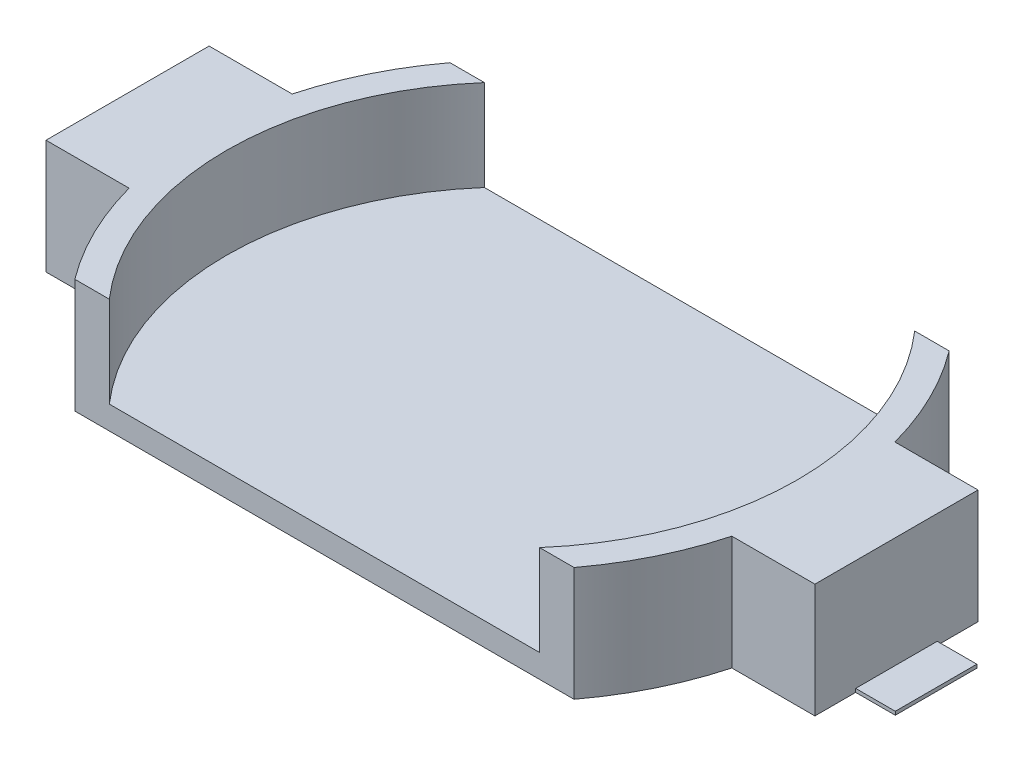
from build123d import *

# Parameters (mm, degrees)
SKETCH1_R           = 13.4
BOSS_EXTRUDE1_DEPTH = 4.9
SKETCH2_R           = 12.25
CUT_EXTRUDE1_DEPTH  = 3.9
SKETCH3_OUTSIDE_W   = 36.444
SKETCH3_OUTSIDE_H   = 36.444
SKETCH3_OUTSIDE_W_2 = 48.201144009
SKETCH3_OUTSIDE_H_2 = 16.1
CUT_EXTRUDE3_DEPTH  = 12.45
SKETCH4_W           = 3.565163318
SKETCH4_H           = 7
BOSS_EXTRUDE3_DEPTH = 4.9
SKETCH5_W           = 1.7
SKETCH5_H           = 3.5
BOSS_EXTRUDE4_DEPTH = 0.15


with BuildPart() as part:
    # Sketch1 → Boss-Extrude1 (new body)
    with BuildSketch(Plane(origin=(0, 0, 0), x_dir=(1, 0, 0), z_dir=(0, 1, 0))):
        with Locations(Location((0, 0, 0), (0, 0, 270))):
            Circle(SKETCH1_R)
    extrude(amount=BOSS_EXTRUDE1_DEPTH)

    # Sketch2 → Cut-Extrude1 (cut)
    with BuildSketch(Plane(origin=(0, 4.9, 0), x_dir=(1, 0, 0), z_dir=(0, 1, 0))):
        with Locations(Location((0, 0, 0), (0, 0, 270))):
            Circle(SKETCH2_R)
    extrude(amount=-CUT_EXTRUDE1_DEPTH, mode=Mode.SUBTRACT)

    # Sketch3 outside → Cut-Extrude3 (cut, symmetric)
    with BuildSketch(Plane(origin=(0, 1, 0), x_dir=(1, 0, 0), z_dir=(0, 1, 0))):
        Rectangle(SKETCH3_OUTSIDE_W, SKETCH3_OUTSIDE_H)
        with Locations((-0.755109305, 0)):
            Rectangle(SKETCH3_OUTSIDE_W_2, SKETCH3_OUTSIDE_H_2, mode=Mode.SUBTRACT)
    extrude(amount=CUT_EXTRUDE3_DEPTH, both=True, mode=Mode.SUBTRACT)

    # Sketch4 → Boss-Extrude3 (add)
    with BuildSketch(Plane.XZ):
        with Locations((-14.717418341, 0)):
            Rectangle(SKETCH4_W, SKETCH4_H)
        with Locations((14.717418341, 0)):
            Rectangle(SKETCH4_W, SKETCH4_H)
    extrude(amount=-BOSS_EXTRUDE3_DEPTH)

    # Sketch5 → Boss-Extrude4 (add)
    with BuildSketch(Plane.XZ):
        with Locations((-17.35, 0)):
            Rectangle(SKETCH5_W, SKETCH5_H)
        with Locations((17.35, 0)):
            Rectangle(SKETCH5_W, SKETCH5_H)
    extrude(amount=-BOSS_EXTRUDE4_DEPTH)


solid = part.part
